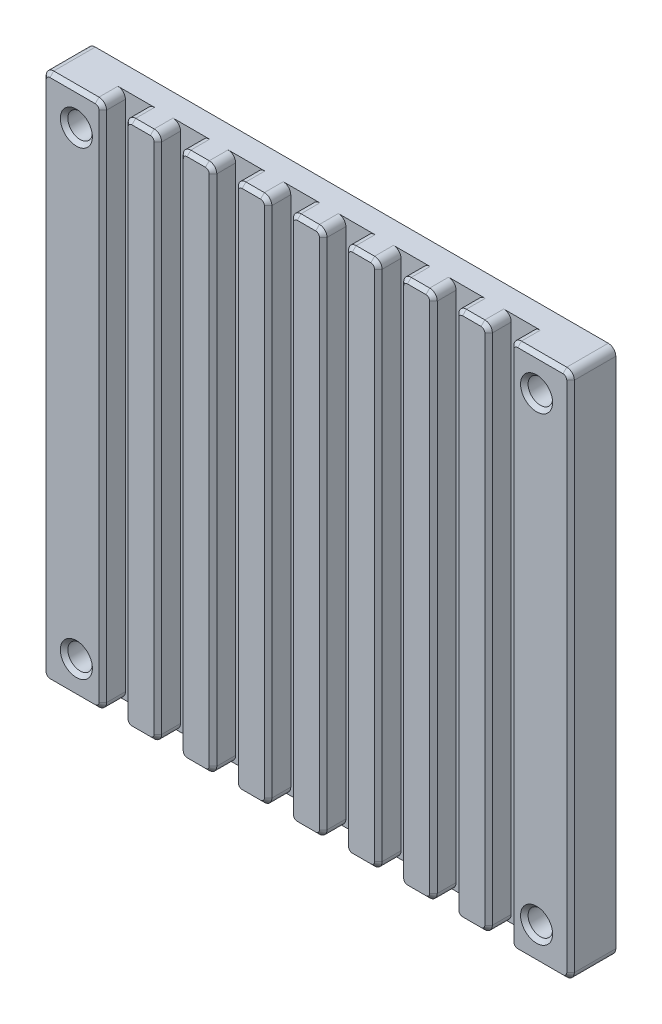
from build123d import *

# Parameters (mm, degrees)
SKETCH1_W           = 70
SKETCH1_H           = 70
SKETCH1_R           = 1.625
BOSS_EXTRUDE1_DEPTH = 6
SKETCH2_W           = 2.859797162
SKETCH2_H           = 70
CUT_EXTRUDE1_DEPTH  = 3
FILLET1_R           = 1
CHAMFER1_SIZE       = 0.5


with BuildPart() as part:
    # Sketch1 → Boss-Extrude1 (new body)
    with BuildSketch(Plane.XY):
        with Locations((35, 35)):
            Rectangle(SKETCH1_W, SKETCH1_H)
        with Locations((4.5, 65.5)):
            Circle(SKETCH1_R, mode=Mode.SUBTRACT)
        with Locations((65.5, 65.5)):
            Circle(SKETCH1_R, mode=Mode.SUBTRACT)
        with Locations((65.5, 4.5)):
            Circle(SKETCH1_R, mode=Mode.SUBTRACT)
        with Locations((4.5, 4.5)):
            Circle(SKETCH1_R, mode=Mode.SUBTRACT)
    extrude(amount=BOSS_EXTRUDE1_DEPTH)

    # Sketch2 → Cut-Extrude1 (cut)
    with BuildSketch(Plane.XY.offset(6)):
        with Locations((9.429898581, 35)):
            Rectangle(SKETCH2_W, SKETCH2_H)
        with Locations((16.735641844, 35)):
            Rectangle(SKETCH2_W, SKETCH2_H)
        with Locations((24.041385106, 35)):
            Rectangle(SKETCH2_W, SKETCH2_H)
        with Locations((31.347128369, 35)):
            Rectangle(SKETCH2_W, SKETCH2_H)
        with Locations((38.652871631, 35)):
            Rectangle(SKETCH2_W, SKETCH2_H)
        with Locations((45.958614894, 35)):
            Rectangle(SKETCH2_W, SKETCH2_H)
        with Locations((53.264358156, 35)):
            Rectangle(SKETCH2_W, SKETCH2_H)
        with Locations((60.570101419, 35)):
            Rectangle(SKETCH2_W, SKETCH2_H)
    extrude(amount=-CUT_EXTRUDE1_DEPTH, mode=Mode.SUBTRACT)

    # Fillet1
    fillet1_edges = [part.edges().sort_by_distance(p)[0] for p in [
        (44.528716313, 70, 4.5),
        (47.388513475, 70, 4.5),
        (47.388513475, 0, 4.5),
        (44.528716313, 0, 4.5),
        (51.834459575, 70, 4.5),
        (54.694256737, 70, 4.5),
        (54.694256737, 0, 4.5),
        (51.834459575, 0, 4.5),
        (59.140202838, 70, 4.5),
        (62, 70, 4.5),
        (62, 0, 4.5),
        (59.140202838, 0, 4.5),
        (8, 0, 4.5),
        (8, 70, 4.5),
        (10.859797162, 70, 4.5),
        (10.859797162, 0, 4.5),
        (0, 70, 3),
        (70, 70, 3),
        (15.305743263, 70, 4.5),
        (70, 0, 3),
        (18.165540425, 70, 4.5),
        (18.165540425, 0, 4.5),
        (15.305743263, 0, 4.5),
        (0, 0, 3),
        (22.611486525, 70, 4.5),
        (25.471283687, 70, 4.5),
        (25.471283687, 0, 4.5),
        (22.611486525, 0, 4.5),
        (29.917229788, 70, 4.5),
        (32.77702695, 70, 4.5),
        (32.77702695, 0, 4.5),
        (29.917229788, 0, 4.5),
        (37.22297305, 70, 4.5),
        (40.082770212, 70, 4.5),
        (40.082770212, 0, 4.5),
        (37.22297305, 0, 4.5),
    ]]
    fillet(fillet1_edges, radius=FILLET1_R)

    # Chamfer1
    chamfer1_edges = [part.edges().sort_by_distance(p)[0] for p in [
        (63.875, 65.5, 6),
        (4, 70, 6),
        (13.082770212, 70, 6),
        (20.388513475, 70, 6),
        (27.694256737, 70, 6),
        (35, 70, 6),
        (42.305743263, 70, 6),
        (49.611486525, 70, 6),
        (56.917229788, 70, 6),
        (66, 70, 6),
        (2.875, 65.5, 6),
        (40.082770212, 35, 6),
        (42.305743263, 0, 6),
        (44.528716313, 35, 6),
        (40.375663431, 0.292893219, 6),
        (44.235823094, 0.292893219, 6),
        (44.235823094, 69.707106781, 6),
        (40.375663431, 69.707106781, 6),
        (47.388513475, 35, 6),
        (49.611486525, 0, 6),
        (51.834459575, 35, 6),
        (47.681406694, 0.292893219, 6),
        (51.541566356, 0.292893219, 6),
        (51.541566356, 69.707106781, 6),
        (47.681406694, 69.707106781, 6),
        (54.694256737, 35, 6),
        (56.917229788, 0, 6),
        (59.140202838, 35, 6),
        (58.847309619, 0.292893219, 6),
        (54.987149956, 0.292893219, 6),
        (58.847309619, 69.707106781, 6),
        (54.987149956, 69.707106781, 6),
        (63.875, 4.5, 6),
        (62, 35, 6),
        (66, 0, 6),
        (70, 35, 6),
        (62.292893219, 0.292893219, 6),
        (69.707106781, 0.292893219, 6),
        (69.707106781, 69.707106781, 6),
        (62.292893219, 69.707106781, 6),
        (4, 0, 6),
        (35, 0, 6),
        (27.694256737, 0, 6),
        (20.388513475, 0, 6),
        (13.082770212, 0, 6),
        (0, 35, 6),
        (8, 35, 6),
        (7.707106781, 0.292893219, 6),
        (7.707106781, 69.707106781, 6),
        (0.292893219, 69.707106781, 6),
        (2.875, 4.5, 6),
        (0.292893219, 0.292893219, 6),
        (15.305743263, 35, 6),
        (10.859797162, 35, 6),
        (15.012850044, 0.292893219, 6),
        (11.152690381, 0.292893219, 6),
        (11.152690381, 69.707106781, 6),
        (15.012850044, 69.707106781, 6),
        (18.165540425, 35, 6),
        (22.611486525, 35, 6),
        (22.318593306, 69.707106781, 6),
        (22.318593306, 0.292893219, 6),
        (18.458433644, 0.292893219, 6),
        (18.458433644, 69.707106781, 6),
        (29.917229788, 35, 6),
        (25.471283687, 35, 6),
        (25.764176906, 0.292893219, 6),
        (25.764176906, 69.707106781, 6),
        (29.624336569, 0.292893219, 6),
        (29.624336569, 69.707106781, 6),
        (37.22297305, 35, 6),
        (32.77702695, 35, 6),
        (36.930079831, 0.292893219, 6),
        (33.069920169, 69.707106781, 6),
        (33.069920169, 0.292893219, 6),
        (36.930079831, 69.707106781, 6),
    ]]
    chamfer(chamfer1_edges, length=CHAMFER1_SIZE)


solid = part.part
